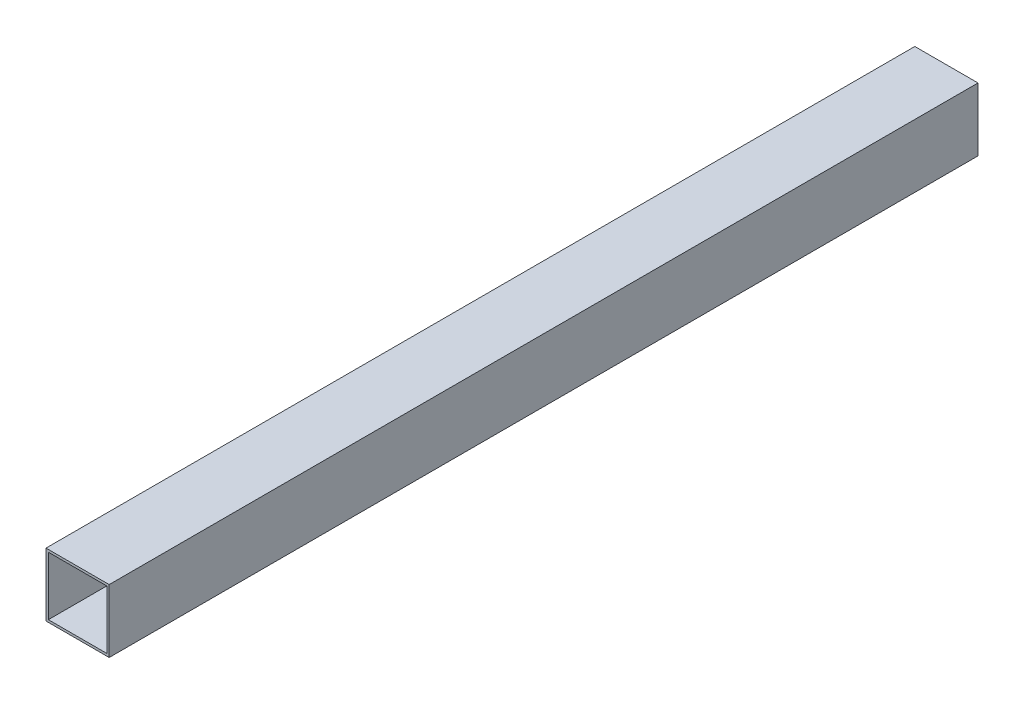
from build123d import *

# Parameters (mm, degrees)
ESQUISSE1_W      = 80
ESQUISSE1_H      = 80
ESQUISSE1_W_2    = 74
ESQUISSE1_H_2    = 74
EXTRUSION1_DEPTH = 1100


with BuildPart() as part:
    # Esquisse1 → Extrusion1 (new body)
    with BuildSketch(Plane.XY):
        with Locations((40, 40)):
            Rectangle(ESQUISSE1_W, ESQUISSE1_H)
        with Locations((40, 40)):
            Rectangle(ESQUISSE1_W_2, ESQUISSE1_H_2, mode=Mode.SUBTRACT)
    extrude(amount=EXTRUSION1_DEPTH)


solid = part.part
